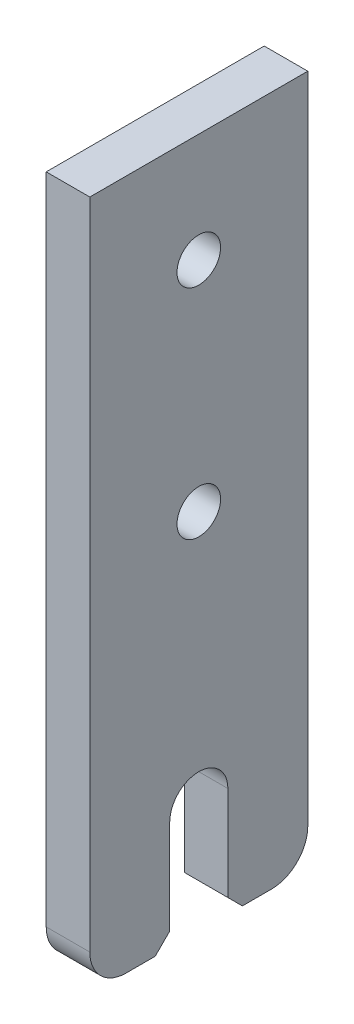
ISO-10303-21;
HEADER;
FILE_DESCRIPTION(('STEP AP214'),'2;1');
FILE_NAME('part.step','',(''),(''),'','','');
FILE_SCHEMA(('AUTOMOTIVE_DESIGN { 1 0 10303 214 1 1 1 1 }'));
ENDSEC;
DATA;
#1=APPLICATION_CONTEXT('core data for automotive mechanical design processes');
#2=APPLICATION_PROTOCOL_DEFINITION('international standard','automotive_design',2000,#1);
#3=PRODUCT_CONTEXT('',#1,'mechanical');
#4=PRODUCT('Part','Part','',(#3));
#5=PRODUCT_RELATED_PRODUCT_CATEGORY('part','',(#4));
#6=PRODUCT_DEFINITION_FORMATION('','',#4);
#7=PRODUCT_DEFINITION_CONTEXT('part definition',#1,'design');
#8=PRODUCT_DEFINITION('design','',#6,#7);
#9=PRODUCT_DEFINITION_SHAPE('','',#8);
#10=(LENGTH_UNIT() NAMED_UNIT(*) SI_UNIT(.MILLI.,.METRE.));
#11=(NAMED_UNIT(*) PLANE_ANGLE_UNIT() SI_UNIT($,.RADIAN.));
#12=(NAMED_UNIT(*) SI_UNIT($,.STERADIAN.) SOLID_ANGLE_UNIT());
#13=UNCERTAINTY_MEASURE_WITH_UNIT(LENGTH_MEASURE(1.E-05),#10,'distance_accuracy_value','');
#14=(GEOMETRIC_REPRESENTATION_CONTEXT(3) GLOBAL_UNCERTAINTY_ASSIGNED_CONTEXT((#13)) GLOBAL_UNIT_ASSIGNED_CONTEXT((#10,
#11,#12)) REPRESENTATION_CONTEXT('',''));
#15=CARTESIAN_POINT('',(0.,0.,0.));
#16=DIRECTION('',(0.,0.,1.));
#17=DIRECTION('',(1.,0.,0.));
#18=AXIS2_PLACEMENT_3D('',#15,#16,#17);
#19=CARTESIAN_POINT('',(2.99999999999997,-47.4999999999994,14.9999999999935));
#20=DIRECTION('',(0.,1.,0.));
#21=DIRECTION('',(0.,0.,1.));
#22=AXIS2_PLACEMENT_3D('',#19,#20,#21);
#23=PLANE('',#22);
#24=DIRECTION('',(0.,0.,-1.));
#25=VECTOR('',#24,1.);
#26=CARTESIAN_POINT('',(2.99999999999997,-47.4999999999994,14.9999999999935));
#27=LINE('',#26,#25);
#28=CARTESIAN_POINT('',(2.99999999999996,-47.4999999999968,-6.000000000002));
#29=VERTEX_POINT('',#28);
#30=CARTESIAN_POINT('',(2.99999999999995,-47.5000000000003,-10.0000000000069));
#31=VERTEX_POINT('',#30);
#32=EDGE_CURVE('E164',#29,#31,#27,.T.);
#33=ORIENTED_EDGE('',*,*,#32,.F.);
#34=DIRECTION('',(-1.,0.,0.));
#35=VECTOR('',#34,1.);
#36=CARTESIAN_POINT('',(2.99999999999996,-47.4999999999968,-6.000000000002));
#37=LINE('',#36,#35);
#38=CARTESIAN_POINT('',(-3.00000000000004,-47.4999999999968,-6.000000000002));
#39=VERTEX_POINT('',#38);
#40=EDGE_CURVE('E209',#29,#39,#37,.T.);
#41=ORIENTED_EDGE('',*,*,#40,.T.);
#42=DIRECTION('',(0.,0.,-1.));
#43=VECTOR('',#42,1.);
#44=CARTESIAN_POINT('',(-3.00000000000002,-47.4999999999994,14.9999999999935));
#45=LINE('',#44,#43);
#46=CARTESIAN_POINT('',(-3.00000000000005,-47.5000000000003,-10.0000000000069));
#47=VERTEX_POINT('',#46);
#48=EDGE_CURVE('E175',#39,#47,#45,.T.);
#49=ORIENTED_EDGE('',*,*,#48,.T.);
#50=DIRECTION('',(-1.,0.,0.));
#51=VECTOR('',#50,1.);
#52=CARTESIAN_POINT('',(2.99999999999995,-47.5000000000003,-10.0000000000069));
#53=LINE('',#52,#51);
#54=EDGE_CURVE('E190',#47,#31,#53,.F.);
#55=ORIENTED_EDGE('',*,*,#54,.T.);
#56=EDGE_LOOP('',(#33,#41,#49,#55));
#57=FACE_BOUND('',#56,.T.);
#58=ADVANCED_FACE('F34',(#57),#23,.F.);
#59=CARTESIAN_POINT('',(2.99999999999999,-47.4999999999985,-15.0000000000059));
#60=DIRECTION('',(0.,0.,1.));
#61=DIRECTION('',(1.,0.,0.));
#62=AXIS2_PLACEMENT_3D('',#59,#60,#61);
#63=PLANE('',#62);
#64=DIRECTION('',(0.,1.,0.));
#65=VECTOR('',#64,1.);
#66=CARTESIAN_POINT('',(2.99999999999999,-47.4999999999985,-15.0000000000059));
#67=LINE('',#66,#65);
#68=CARTESIAN_POINT('',(2.99999999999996,-42.499999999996,-15.0000000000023));
#69=VERTEX_POINT('',#68);
#70=CARTESIAN_POINT('',(3.,47.5000000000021,-15.0000000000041));
#71=VERTEX_POINT('',#70);
#72=EDGE_CURVE('E156',#69,#71,#67,.T.);
#73=ORIENTED_EDGE('',*,*,#72,.F.);
#74=DIRECTION('',(-1.,0.,0.));
#75=VECTOR('',#74,1.);
#76=CARTESIAN_POINT('',(2.99999999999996,-42.499999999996,-15.0000000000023));
#77=LINE('',#76,#75);
#78=CARTESIAN_POINT('',(-3.00000000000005,-42.499999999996,-15.0000000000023));
#79=VERTEX_POINT('',#78);
#80=EDGE_CURVE('E182',#69,#79,#77,.T.);
#81=ORIENTED_EDGE('',*,*,#80,.T.);
#82=DIRECTION('',(0.,1.,0.));
#83=VECTOR('',#82,1.);
#84=CARTESIAN_POINT('',(-3.00000000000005,-47.4999999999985,-15.0000000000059));
#85=LINE('',#84,#83);
#86=CARTESIAN_POINT('',(-3.00000000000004,47.5000000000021,-15.0000000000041));
#87=VERTEX_POINT('',#86);
#88=EDGE_CURVE('E154',#79,#87,#85,.T.);
#89=ORIENTED_EDGE('',*,*,#88,.T.);
#90=DIRECTION('',(-1.,0.,0.));
#91=VECTOR('',#90,1.);
#92=CARTESIAN_POINT('',(3.,47.5000000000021,-15.0000000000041));
#93=LINE('',#92,#91);
#94=EDGE_CURVE('E179',#71,#87,#93,.T.);
#95=ORIENTED_EDGE('',*,*,#94,.F.);
#96=EDGE_LOOP('',(#73,#81,#89,#95));
#97=FACE_BOUND('',#96,.T.);
#98=ADVANCED_FACE('F241',(#97),#63,.F.);
#99=CARTESIAN_POINT('',(2.99999999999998,47.5000000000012,14.9999999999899));
#100=DIRECTION('',(0.,-1.,0.));
#101=DIRECTION('',(0.,0.,-1.));
#102=AXIS2_PLACEMENT_3D('',#99,#100,#101);
#103=PLANE('',#102);
#104=DIRECTION('',(0.,0.,1.));
#105=VECTOR('',#104,1.);
#106=CARTESIAN_POINT('',(-3.00000000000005,47.5000000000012,14.9999999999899));
#107=LINE('',#106,#105);
#108=CARTESIAN_POINT('',(-3.00000000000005,47.5000000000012,14.9999999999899));
#109=VERTEX_POINT('',#108);
#110=EDGE_CURVE('E170',#87,#109,#107,.T.);
#111=ORIENTED_EDGE('',*,*,#110,.T.);
#112=DIRECTION('',(-1.,0.,0.));
#113=VECTOR('',#112,1.);
#114=CARTESIAN_POINT('',(2.99999999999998,47.5000000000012,14.9999999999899));
#115=LINE('',#114,#113);
#116=CARTESIAN_POINT('',(2.99999999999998,47.5000000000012,14.9999999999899));
#117=VERTEX_POINT('',#116);
#118=EDGE_CURVE('E168',#117,#109,#115,.T.);
#119=ORIENTED_EDGE('',*,*,#118,.F.);
#120=DIRECTION('',(0.,0.,1.));
#121=VECTOR('',#120,1.);
#122=CARTESIAN_POINT('',(2.99999999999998,47.5000000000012,14.9999999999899));
#123=LINE('',#122,#121);
#124=EDGE_CURVE('E158',#71,#117,#123,.T.);
#125=ORIENTED_EDGE('',*,*,#124,.F.);
#126=ORIENTED_EDGE('',*,*,#94,.T.);
#127=EDGE_LOOP('',(#111,#119,#125,#126));
#128=FACE_BOUND('',#127,.T.);
#129=ADVANCED_FACE('F235',(#128),#103,.F.);
#130=CARTESIAN_POINT('',(2.99999999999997,-47.4999999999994,14.9999999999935));
#131=DIRECTION('',(0.,0.,-1.));
#132=DIRECTION('',(-1.,0.,0.));
#133=AXIS2_PLACEMENT_3D('',#130,#131,#132);
#134=PLANE('',#133);
#135=DIRECTION('',(0.,-1.,0.));
#136=VECTOR('',#135,1.);
#137=CARTESIAN_POINT('',(-3.00000000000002,-47.4999999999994,14.9999999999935));
#138=LINE('',#137,#136);
#139=CARTESIAN_POINT('',(-3.00000000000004,-42.4999999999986,14.9999999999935));
#140=VERTEX_POINT('',#139);
#141=EDGE_CURVE('E172',#109,#140,#138,.T.);
#142=ORIENTED_EDGE('',*,*,#141,.T.);
#143=DIRECTION('',(-1.,0.,0.));
#144=VECTOR('',#143,1.);
#145=CARTESIAN_POINT('',(2.99999999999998,-42.4999999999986,14.9999999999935));
#146=LINE('',#145,#144);
#147=CARTESIAN_POINT('',(2.99999999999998,-42.4999999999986,14.9999999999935));
#148=VERTEX_POINT('',#147);
#149=EDGE_CURVE('E200',#140,#148,#146,.F.);
#150=ORIENTED_EDGE('',*,*,#149,.T.);
#151=DIRECTION('',(0.,-1.,0.));
#152=VECTOR('',#151,1.);
#153=CARTESIAN_POINT('',(2.99999999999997,-47.4999999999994,14.9999999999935));
#154=LINE('',#153,#152);
#155=EDGE_CURVE('E161',#117,#148,#154,.T.);
#156=ORIENTED_EDGE('',*,*,#155,.F.);
#157=ORIENTED_EDGE('',*,*,#118,.T.);
#158=EDGE_LOOP('',(#142,#150,#156,#157));
#159=FACE_BOUND('',#158,.T.);
#160=ADVANCED_FACE('F231',(#159),#134,.F.);
#161=CARTESIAN_POINT('',(-3.00000000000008,-47.4999999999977,9.99999999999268));
#162=VERTEX_POINT('',#161);
#163=CARTESIAN_POINT('',(-3.00000000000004,-47.4999999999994,6.00000000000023));
#164=VERTEX_POINT('',#163);
#165=EDGE_CURVE('E159',#162,#164,#45,.T.);
#166=ORIENTED_EDGE('',*,*,#165,.T.);
#167=DIRECTION('',(1.,0.,0.));
#168=VECTOR('',#167,1.);
#169=CARTESIAN_POINT('',(2.99999999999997,-47.4999999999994,6.00000000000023));
#170=LINE('',#169,#168);
#171=CARTESIAN_POINT('',(2.99999999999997,-47.4999999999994,6.00000000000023));
#172=VERTEX_POINT('',#171);
#173=EDGE_CURVE('E42',#164,#172,#170,.T.);
#174=ORIENTED_EDGE('',*,*,#173,.T.);
#175=CARTESIAN_POINT('',(2.99999999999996,-47.4999999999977,9.99999999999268));
#176=VERTEX_POINT('',#175);
#177=EDGE_CURVE('E165',#176,#172,#27,.T.);
#178=ORIENTED_EDGE('',*,*,#177,.F.);
#179=DIRECTION('',(-1.,0.,0.));
#180=VECTOR('',#179,1.);
#181=CARTESIAN_POINT('',(2.99999999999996,-47.4999999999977,9.99999999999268));
#182=LINE('',#181,#180);
#183=EDGE_CURVE('E197',#176,#162,#182,.T.);
#184=ORIENTED_EDGE('',*,*,#183,.T.);
#185=EDGE_LOOP('',(#166,#174,#178,#184));
#186=FACE_BOUND('',#185,.T.);
#187=ADVANCED_FACE('F217',(#186),#23,.F.);
#188=CARTESIAN_POINT('',(3.,0.,0.));
#189=DIRECTION('',(-1.,0.,0.));
#190=DIRECTION('',(0.,0.,1.));
#191=AXIS2_PLACEMENT_3D('',#188,#189,#190);
#192=PLANE('',#191);
#193=CARTESIAN_POINT('',(3.,2.50000000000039,-3.5527136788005E-12));
#194=DIRECTION('',(1.,0.,0.));
#195=DIRECTION('',(0.,0.,-1.));
#196=AXIS2_PLACEMENT_3D('',#193,#194,#195);
#197=CIRCLE('',#196,3.);
#198=CARTESIAN_POINT('',(3.,2.50000000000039,-3.00000000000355));
#199=VERTEX_POINT('',#198);
#200=EDGE_CURVE('E362',#199,#199,#197,.T.);
#201=ORIENTED_EDGE('',*,*,#200,.F.);
#202=EDGE_LOOP('',(#201));
#203=FACE_BOUND('',#202,.T.);
#204=CARTESIAN_POINT('',(3.,32.5000000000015,-7.105427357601E-12));
#205=DIRECTION('',(1.,0.,0.));
#206=DIRECTION('',(0.,0.,-1.));
#207=AXIS2_PLACEMENT_3D('',#204,#205,#206);
#208=CIRCLE('',#207,3.);
#209=CARTESIAN_POINT('',(3.,32.5000000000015,-3.00000000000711));
#210=VERTEX_POINT('',#209);
#211=EDGE_CURVE('E147',#210,#210,#208,.T.);
#212=ORIENTED_EDGE('',*,*,#211,.F.);
#213=EDGE_LOOP('',(#212));
#214=FACE_BOUND('',#213,.T.);
#215=DIRECTION('',(0.,0.999999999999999,0.));
#216=VECTOR('',#215,1.);
#217=CARTESIAN_POINT('',(3.,-47.4999999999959,-4.00000000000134));
#218=LINE('',#217,#216);
#219=CARTESIAN_POINT('',(2.99999999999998,-45.4999999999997,-4.00000000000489));
#220=VERTEX_POINT('',#219);
#221=CARTESIAN_POINT('',(3.00000000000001,-32.4999999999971,-4.00000000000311));
#222=VERTEX_POINT('',#221);
#223=EDGE_CURVE('E142',#220,#222,#218,.T.);
#224=ORIENTED_EDGE('',*,*,#223,.F.);
#225=DIRECTION('',(0.,0.707106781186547,0.707106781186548));
#226=VECTOR('',#225,1.);
#227=CARTESIAN_POINT('',(2.99999999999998,-45.4999999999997,-4.00000000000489));
#228=LINE('',#227,#226);
#229=EDGE_CURVE('E207',#220,#29,#228,.F.);
#230=ORIENTED_EDGE('',*,*,#229,.T.);
#231=ORIENTED_EDGE('',*,*,#32,.T.);
#232=CARTESIAN_POINT('',(2.99999999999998,-42.4999999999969,-10.0000000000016));
#233=DIRECTION('',(-1.,0.,0.));
#234=DIRECTION('',(0.,0.,1.));
#235=AXIS2_PLACEMENT_3D('',#232,#233,#234);
#236=CIRCLE('',#235,5.);
#237=EDGE_CURVE('E195',#31,#69,#236,.F.);
#238=ORIENTED_EDGE('',*,*,#237,.T.);
#239=ORIENTED_EDGE('',*,*,#72,.T.);
#240=ORIENTED_EDGE('',*,*,#124,.T.);
#241=ORIENTED_EDGE('',*,*,#155,.T.);
#242=CARTESIAN_POINT('',(2.99999999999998,-42.4999999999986,9.99999999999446));
#243=DIRECTION('',(-1.,0.,0.));
#244=DIRECTION('',(0.,0.,1.));
#245=AXIS2_PLACEMENT_3D('',#242,#243,#244);
#246=CIRCLE('',#245,5.);
#247=EDGE_CURVE('E193',#148,#176,#246,.F.);
#248=ORIENTED_EDGE('',*,*,#247,.T.);
#249=ORIENTED_EDGE('',*,*,#177,.T.);
#250=DIRECTION('',(0.,-0.70710678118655,0.707106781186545));
#251=VECTOR('',#250,1.);
#252=CARTESIAN_POINT('',(2.99999999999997,-47.4999999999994,6.00000000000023));
#253=LINE('',#252,#251);
#254=CARTESIAN_POINT('',(2.99999999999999,-45.4999999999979,3.99999999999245));
#255=VERTEX_POINT('',#254);
#256=EDGE_CURVE('E205',#172,#255,#253,.F.);
#257=ORIENTED_EDGE('',*,*,#256,.T.);
#258=DIRECTION('',(0.,-1.,0.));
#259=VECTOR('',#258,1.);
#260=CARTESIAN_POINT('',(2.99999999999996,-32.4999999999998,3.99999999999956));
#261=LINE('',#260,#259);
#262=CARTESIAN_POINT('',(2.99999999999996,-32.4999999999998,3.99999999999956));
#263=VERTEX_POINT('',#262);
#264=EDGE_CURVE('E144',#263,#255,#261,.T.);
#265=ORIENTED_EDGE('',*,*,#264,.F.);
#266=CARTESIAN_POINT('',(2.99999999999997,-32.4999999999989,-8.88178419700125E-12));
#267=DIRECTION('',(1.,0.,0.));
#268=DIRECTION('',(0.,0.,-1.));
#269=AXIS2_PLACEMENT_3D('',#266,#267,#268);
#270=CIRCLE('',#269,4.);
#271=EDGE_CURVE('E130',#222,#263,#270,.T.);
#272=ORIENTED_EDGE('',*,*,#271,.F.);
#273=EDGE_LOOP('',(#224,#230,#231,#238,#239,#240,#241,#248,#249,#257,#265,#272));
#274=FACE_BOUND('',#273,.T.);
#275=ADVANCED_FACE('F222',(#203,#214,#274),#192,.F.);
#276=CARTESIAN_POINT('',(-3.00000000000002,0.,0.));
#277=DIRECTION('',(-1.,0.,0.));
#278=DIRECTION('',(0.,0.,1.));
#279=AXIS2_PLACEMENT_3D('',#276,#277,#278);
#280=PLANE('',#279);
#281=CARTESIAN_POINT('',(-3.00000000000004,2.50000000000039,-3.5527136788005E-12));
#282=DIRECTION('',(1.,0.,0.));
#283=DIRECTION('',(0.,0.,-1.));
#284=AXIS2_PLACEMENT_3D('',#281,#282,#283);
#285=CIRCLE('',#284,3.);
#286=CARTESIAN_POINT('',(-3.00000000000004,2.50000000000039,-3.00000000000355));
#287=VERTEX_POINT('',#286);
#288=EDGE_CURVE('E357',#287,#287,#285,.T.);
#289=ORIENTED_EDGE('',*,*,#288,.T.);
#290=EDGE_LOOP('',(#289));
#291=FACE_BOUND('',#290,.T.);
#292=CARTESIAN_POINT('',(-3.00000000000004,32.5000000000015,-7.105427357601E-12));
#293=DIRECTION('',(1.,0.,0.));
#294=DIRECTION('',(0.,0.,-1.));
#295=AXIS2_PLACEMENT_3D('',#292,#293,#294);
#296=CIRCLE('',#295,3.);
#297=CARTESIAN_POINT('',(-3.00000000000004,32.5000000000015,-3.00000000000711));
#298=VERTEX_POINT('',#297);
#299=EDGE_CURVE('E152',#298,#298,#296,.T.);
#300=ORIENTED_EDGE('',*,*,#299,.T.);
#301=EDGE_LOOP('',(#300));
#302=FACE_BOUND('',#301,.T.);
#303=ORIENTED_EDGE('',*,*,#48,.F.);
#304=DIRECTION('',(0.,-0.707106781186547,-0.707106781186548));
#305=VECTOR('',#304,1.);
#306=CARTESIAN_POINT('',(-3.00000000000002,-20.7500000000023,20.7499999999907));
#307=LINE('',#306,#305);
#308=CARTESIAN_POINT('',(-3.00000000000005,-45.4999999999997,-4.00000000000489));
#309=VERTEX_POINT('',#308);
#310=EDGE_CURVE('E212',#39,#309,#307,.F.);
#311=ORIENTED_EDGE('',*,*,#310,.T.);
#312=DIRECTION('',(0.,0.999999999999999,0.));
#313=VECTOR('',#312,1.);
#314=CARTESIAN_POINT('',(-3.00000000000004,-47.4999999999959,-4.00000000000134));
#315=LINE('',#314,#313);
#316=CARTESIAN_POINT('',(-3.00000000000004,-32.4999999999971,-4.00000000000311));
#317=VERTEX_POINT('',#316);
#318=EDGE_CURVE('E133',#309,#317,#315,.T.);
#319=ORIENTED_EDGE('',*,*,#318,.T.);
#320=CARTESIAN_POINT('',(-3.00000000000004,-32.4999999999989,-8.88178419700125E-12));
#321=DIRECTION('',(1.,0.,0.));
#322=DIRECTION('',(0.,0.,-1.));
#323=AXIS2_PLACEMENT_3D('',#320,#321,#322);
#324=CIRCLE('',#323,4.);
#325=CARTESIAN_POINT('',(-3.00000000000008,-32.4999999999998,3.99999999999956));
#326=VERTEX_POINT('',#325);
#327=EDGE_CURVE('E128',#317,#326,#324,.T.);
#328=ORIENTED_EDGE('',*,*,#327,.T.);
#329=DIRECTION('',(0.,-1.,0.));
#330=VECTOR('',#329,1.);
#331=CARTESIAN_POINT('',(-3.00000000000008,-32.4999999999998,3.99999999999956));
#332=LINE('',#331,#330);
#333=CARTESIAN_POINT('',(-3.00000000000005,-45.4999999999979,3.99999999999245));
#334=VERTEX_POINT('',#333);
#335=EDGE_CURVE('E135',#326,#334,#332,.T.);
#336=ORIENTED_EDGE('',*,*,#335,.T.);
#337=DIRECTION('',(0.,0.70710678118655,-0.707106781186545));
#338=VECTOR('',#337,1.);
#339=CARTESIAN_POINT('',(-3.00000000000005,-20.7499999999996,-20.7500000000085));
#340=LINE('',#339,#338);
#341=EDGE_CURVE('E49',#334,#164,#340,.F.);
#342=ORIENTED_EDGE('',*,*,#341,.T.);
#343=ORIENTED_EDGE('',*,*,#165,.F.);
#344=CARTESIAN_POINT('',(-3.00000000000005,-42.4999999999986,9.99999999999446));
#345=DIRECTION('',(-1.,0.,0.));
#346=DIRECTION('',(0.,0.,1.));
#347=AXIS2_PLACEMENT_3D('',#344,#345,#346);
#348=CIRCLE('',#347,5.);
#349=EDGE_CURVE('E185',#162,#140,#348,.T.);
#350=ORIENTED_EDGE('',*,*,#349,.T.);
#351=ORIENTED_EDGE('',*,*,#141,.F.);
#352=ORIENTED_EDGE('',*,*,#110,.F.);
#353=ORIENTED_EDGE('',*,*,#88,.F.);
#354=CARTESIAN_POINT('',(-3.00000000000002,-42.4999999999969,-10.0000000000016));
#355=DIRECTION('',(-1.,0.,0.));
#356=DIRECTION('',(0.,0.,1.));
#357=AXIS2_PLACEMENT_3D('',#354,#355,#356);
#358=CIRCLE('',#357,5.);
#359=EDGE_CURVE('E187',#79,#47,#358,.T.);
#360=ORIENTED_EDGE('',*,*,#359,.T.);
#361=EDGE_LOOP('',(#303,#311,#319,#328,#336,#342,#343,#350,#351,#352,#353,#360));
#362=FACE_BOUND('',#361,.T.);
#363=ADVANCED_FACE('F139',(#291,#302,#362),#280,.T.);
#364=CARTESIAN_POINT('',(-3.00000000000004,-32.4999999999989,-8.88178419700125E-12));
#365=DIRECTION('',(1.,0.,0.));
#366=DIRECTION('',(0.,0.,-1.));
#367=AXIS2_PLACEMENT_3D('',#364,#365,#366);
#368=CYLINDRICAL_SURFACE('',#367,4.);
#369=ORIENTED_EDGE('',*,*,#271,.T.);
#370=DIRECTION('',(1.,0.,0.));
#371=VECTOR('',#370,1.);
#372=CARTESIAN_POINT('',(-3.00000000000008,-32.4999999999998,3.99999999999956));
#373=LINE('',#372,#371);
#374=EDGE_CURVE('E124',#326,#263,#373,.T.);
#375=ORIENTED_EDGE('',*,*,#374,.F.);
#376=ORIENTED_EDGE('',*,*,#327,.F.);
#377=DIRECTION('',(1.,0.,0.));
#378=VECTOR('',#377,1.);
#379=CARTESIAN_POINT('',(-3.00000000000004,-32.4999999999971,-4.00000000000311));
#380=LINE('',#379,#378);
#381=EDGE_CURVE('E132',#317,#222,#380,.T.);
#382=ORIENTED_EDGE('',*,*,#381,.T.);
#383=EDGE_LOOP('',(#369,#375,#376,#382));
#384=FACE_BOUND('',#383,.T.);
#385=ADVANCED_FACE('F125',(#384),#368,.F.);
#386=CARTESIAN_POINT('',(-3.00000000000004,-47.4999999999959,-4.00000000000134));
#387=DIRECTION('',(0.,0.,-1.));
#388=DIRECTION('',(0.,0.999999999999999,0.));
#389=AXIS2_PLACEMENT_3D('',#386,#387,#388);
#390=PLANE('',#389);
#391=ORIENTED_EDGE('',*,*,#318,.F.);
#392=DIRECTION('',(1.,0.,0.));
#393=VECTOR('',#392,1.);
#394=CARTESIAN_POINT('',(-3.00000000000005,-45.4999999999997,-4.00000000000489));
#395=LINE('',#394,#393);
#396=EDGE_CURVE('E202',#309,#220,#395,.T.);
#397=ORIENTED_EDGE('',*,*,#396,.T.);
#398=ORIENTED_EDGE('',*,*,#223,.T.);
#399=ORIENTED_EDGE('',*,*,#381,.F.);
#400=EDGE_LOOP('',(#391,#397,#398,#399));
#401=FACE_BOUND('',#400,.T.);
#402=ADVANCED_FACE('F254',(#401),#390,.F.);
#403=CARTESIAN_POINT('',(-3.00000000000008,-32.4999999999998,3.99999999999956));
#404=DIRECTION('',(0.,0.,1.));
#405=DIRECTION('',(0.,-1.,0.));
#406=AXIS2_PLACEMENT_3D('',#403,#404,#405);
#407=PLANE('',#406);
#408=ORIENTED_EDGE('',*,*,#264,.T.);
#409=DIRECTION('',(-1.,0.,0.));
#410=VECTOR('',#409,1.);
#411=CARTESIAN_POINT('',(-3.00000000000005,-45.4999999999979,3.99999999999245));
#412=LINE('',#411,#410);
#413=EDGE_CURVE('E11',#255,#334,#412,.T.);
#414=ORIENTED_EDGE('',*,*,#413,.T.);
#415=ORIENTED_EDGE('',*,*,#335,.F.);
#416=ORIENTED_EDGE('',*,*,#374,.T.);
#417=EDGE_LOOP('',(#408,#414,#415,#416));
#418=FACE_BOUND('',#417,.T.);
#419=ADVANCED_FACE('F136',(#418),#407,.F.);
#420=CARTESIAN_POINT('',(-3.00000000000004,32.5000000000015,-7.105427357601E-12));
#421=DIRECTION('',(1.,0.,0.));
#422=DIRECTION('',(0.,0.,-1.));
#423=AXIS2_PLACEMENT_3D('',#420,#421,#422);
#424=CYLINDRICAL_SURFACE('',#423,3.);
#425=ORIENTED_EDGE('',*,*,#299,.F.);
#426=EDGE_LOOP('',(#425));
#427=FACE_BOUND('',#426,.T.);
#428=ORIENTED_EDGE('',*,*,#211,.T.);
#429=EDGE_LOOP('',(#428));
#430=FACE_BOUND('',#429,.T.);
#431=ADVANCED_FACE('F301',(#427,#430),#424,.F.);
#432=CARTESIAN_POINT('',(-3.00000000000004,2.50000000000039,-3.5527136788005E-12));
#433=DIRECTION('',(1.,0.,0.));
#434=DIRECTION('',(0.,0.,-1.));
#435=AXIS2_PLACEMENT_3D('',#432,#433,#434);
#436=CYLINDRICAL_SURFACE('',#435,3.);
#437=ORIENTED_EDGE('',*,*,#288,.F.);
#438=EDGE_LOOP('',(#437));
#439=FACE_BOUND('',#438,.T.);
#440=ORIENTED_EDGE('',*,*,#200,.T.);
#441=EDGE_LOOP('',(#440));
#442=FACE_BOUND('',#441,.T.);
#443=ADVANCED_FACE('F281',(#439,#442),#436,.F.);
#444=CARTESIAN_POINT('',(2.99999999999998,-42.4999999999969,-10.0000000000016));
#445=DIRECTION('',(-1.,0.,0.));
#446=DIRECTION('',(0.,0.,1.));
#447=AXIS2_PLACEMENT_3D('',#444,#445,#446);
#448=CYLINDRICAL_SURFACE('',#447,5.);
#449=ORIENTED_EDGE('',*,*,#237,.F.);
#450=ORIENTED_EDGE('',*,*,#54,.F.);
#451=ORIENTED_EDGE('',*,*,#359,.F.);
#452=ORIENTED_EDGE('',*,*,#80,.F.);
#453=EDGE_LOOP('',(#449,#450,#451,#452));
#454=FACE_BOUND('',#453,.T.);
#455=ADVANCED_FACE('F245',(#454),#448,.T.);
#456=CARTESIAN_POINT('',(2.99999999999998,-42.4999999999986,9.99999999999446));
#457=DIRECTION('',(-1.,0.,0.));
#458=DIRECTION('',(0.,0.,1.));
#459=AXIS2_PLACEMENT_3D('',#456,#457,#458);
#460=CYLINDRICAL_SURFACE('',#459,5.);
#461=ORIENTED_EDGE('',*,*,#247,.F.);
#462=ORIENTED_EDGE('',*,*,#149,.F.);
#463=ORIENTED_EDGE('',*,*,#349,.F.);
#464=ORIENTED_EDGE('',*,*,#183,.F.);
#465=EDGE_LOOP('',(#461,#462,#463,#464));
#466=FACE_BOUND('',#465,.T.);
#467=ADVANCED_FACE('F227',(#466),#460,.T.);
#468=CARTESIAN_POINT('',(-3.00000000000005,-45.4999999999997,-4.00000000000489));
#469=DIRECTION('',(0.,0.707106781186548,-0.707106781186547));
#470=DIRECTION('',(1.,0.,0.));
#471=AXIS2_PLACEMENT_3D('',#468,#469,#470);
#472=PLANE('',#471);
#473=ORIENTED_EDGE('',*,*,#310,.F.);
#474=ORIENTED_EDGE('',*,*,#40,.F.);
#475=ORIENTED_EDGE('',*,*,#229,.F.);
#476=ORIENTED_EDGE('',*,*,#396,.F.);
#477=EDGE_LOOP('',(#473,#474,#475,#476));
#478=FACE_BOUND('',#477,.T.);
#479=ADVANCED_FACE('F252',(#478),#472,.F.);
#480=CARTESIAN_POINT('',(2.99999999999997,-47.4999999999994,6.00000000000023));
#481=DIRECTION('',(0.,0.707106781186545,0.70710678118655));
#482=DIRECTION('',(1.,0.,0.));
#483=AXIS2_PLACEMENT_3D('',#480,#481,#482);
#484=PLANE('',#483);
#485=ORIENTED_EDGE('',*,*,#341,.F.);
#486=ORIENTED_EDGE('',*,*,#413,.F.);
#487=ORIENTED_EDGE('',*,*,#256,.F.);
#488=ORIENTED_EDGE('',*,*,#173,.F.);
#489=EDGE_LOOP('',(#485,#486,#487,#488));
#490=FACE_BOUND('',#489,.T.);
#491=ADVANCED_FACE('F36',(#490),#484,.F.);
#492=CLOSED_SHELL('',(#58,#98,#129,#160,#187,#275,#363,#385,#402,#419,#431,#443,#455,#467,#479,#491));
#493=MANIFOLD_SOLID_BREP('B2',#492);
#494=ADVANCED_BREP_SHAPE_REPRESENTATION('',(#18,#493),#14);
#495=SHAPE_DEFINITION_REPRESENTATION(#9,#494);
ENDSEC;
END-ISO-10303-21;
